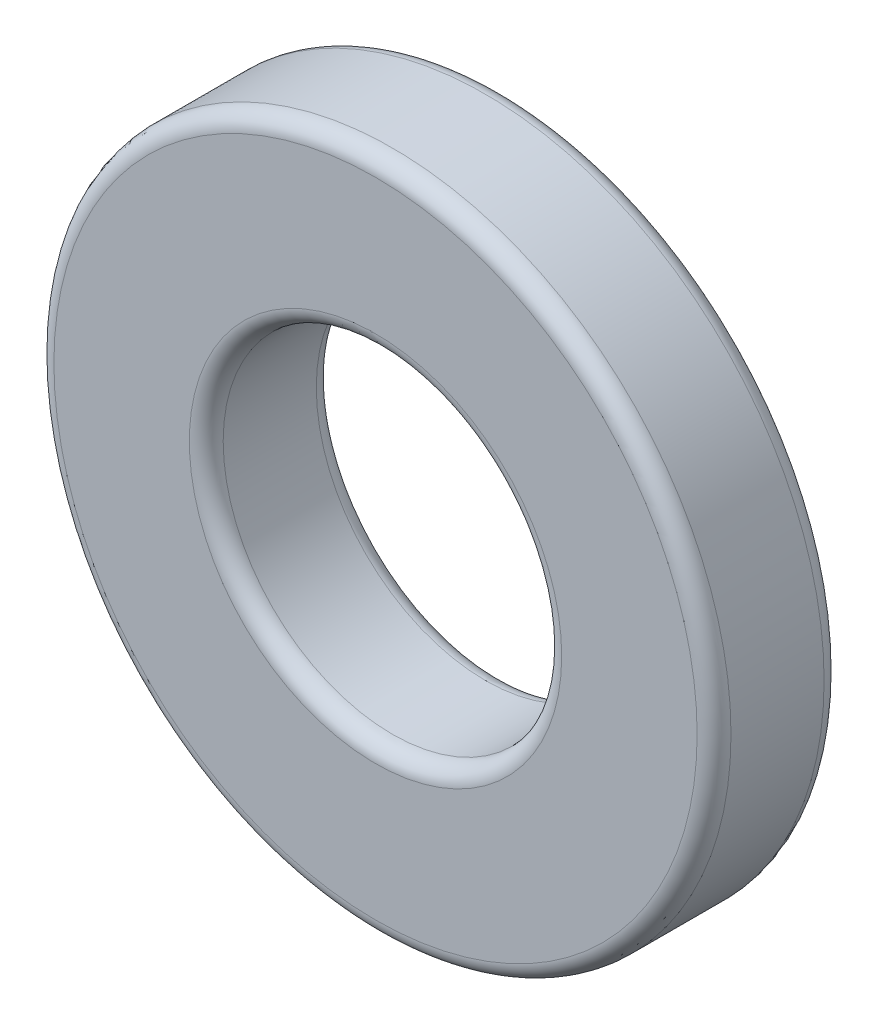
from build123d import *

# Parameters (mm, degrees)
ESQUISSE1_R        = 4
ESQUISSE1_R_2      = 2
BOSS_EXTRU_1_DEPTH = 1.5
CONG_3_R           = 0.2


with BuildPart() as part:
    # Esquisse1 → Boss.-Extru.1 (new body)
    with BuildSketch(Plane.XY):
        Circle(ESQUISSE1_R)
        Circle(ESQUISSE1_R_2, mode=Mode.SUBTRACT)
    extrude(amount=BOSS_EXTRU_1_DEPTH)

    # Cong_3
    cong_3_edges = [part.edges().sort_by_distance(p)[0] for p in [
        (-4, 0, 0),
        (-4, 0, 1.5),
        (-2, 0, 0),
        (-2, 0, 1.5),
    ]]
    fillet(cong_3_edges, radius=CONG_3_R)


solid = part.part
